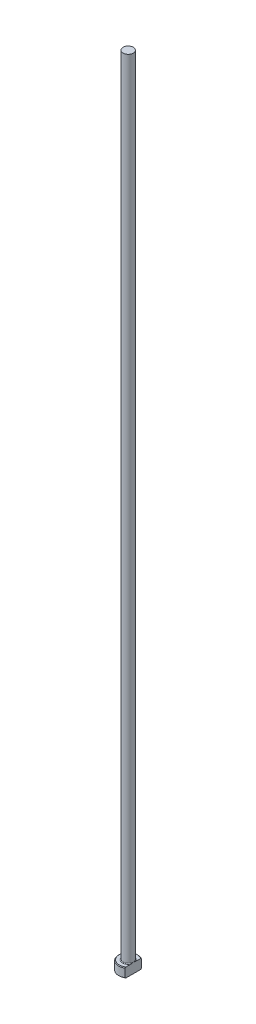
from build123d import *
from build123d.topology import SkipClean

# Parameters (mm, degrees)
CHAMFER1_SIZE = 0.2
FILLET1_R     = 0.2
KEY_DEPTH     = 251.035997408


with BuildPart() as part:
    # Sketch1 → Revolve1 (revolve)
    with BuildSketch(Plane.XY, mode=Mode.PRIVATE) as revolve1_sk:
        Polygon((0, 0), (-3, 0), (-3, 3), (-1.6, 3), (-1.6, 250), (0, 250), align=None)
    revolve(revolve1_sk.sketch.rotate(Axis((0, 259.958771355, 0), (0, -1, 0)), 270), axis=Axis((0, 259.958771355, 0), (0, -1, 0)))

    # Chamfer1
    chamfer1_edges = [part.edges().sort_by_distance(p)[0] for p in [
        (0, 3, -3),
        (0, 0, -3),
    ]]
    chamfer(chamfer1_edges, length=CHAMFER1_SIZE)

    # Fillet1
    fillet1_edges = [part.edges().sort_by_distance(p)[0] for p in [
        (0, 3, -1.6),
    ]]
    fillet(fillet1_edges, radius=FILLET1_R)

    # Sketch2 → KEY (cut, through all)
    with SkipClean():  # the faces are left unmerged after this step: merging them gives an invalid solid
        with BuildSketch(Plane(origin=(0, 0, 0), x_dir=(1, 0, 0), z_dir=(0, 1, 0))):
            with BuildLine():
                Line((1.6, 2.537715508), (1.6, -2.537715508))
                ThreePointArc((1.6, -2.537715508), (3, 0), (1.6, 2.537715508))
            make_face()
        extrude(amount=KEY_DEPTH, mode=Mode.SUBTRACT)


solid = part.part
